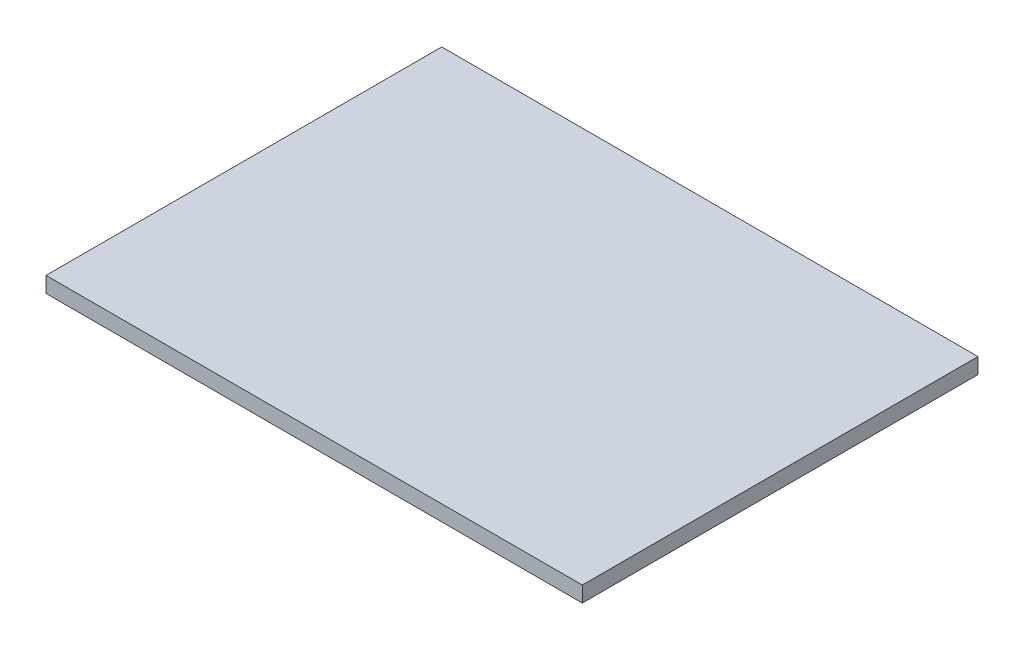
ISO-10303-21;
HEADER;
FILE_DESCRIPTION(('STEP AP214'),'2;1');
FILE_NAME('part.step','',(''),(''),'','','');
FILE_SCHEMA(('AUTOMOTIVE_DESIGN { 1 0 10303 214 1 1 1 1 }'));
ENDSEC;
DATA;
#1=APPLICATION_CONTEXT('core data for automotive mechanical design processes');
#2=APPLICATION_PROTOCOL_DEFINITION('international standard','automotive_design',2000,#1);
#3=PRODUCT_CONTEXT('',#1,'mechanical');
#4=PRODUCT('Part','Part','',(#3));
#5=PRODUCT_RELATED_PRODUCT_CATEGORY('part','',(#4));
#6=PRODUCT_DEFINITION_FORMATION('','',#4);
#7=PRODUCT_DEFINITION_CONTEXT('part definition',#1,'design');
#8=PRODUCT_DEFINITION('design','',#6,#7);
#9=PRODUCT_DEFINITION_SHAPE('','',#8);
#10=(LENGTH_UNIT() NAMED_UNIT(*) SI_UNIT(.MILLI.,.METRE.));
#11=(NAMED_UNIT(*) PLANE_ANGLE_UNIT() SI_UNIT($,.RADIAN.));
#12=(NAMED_UNIT(*) SI_UNIT($,.STERADIAN.) SOLID_ANGLE_UNIT());
#13=UNCERTAINTY_MEASURE_WITH_UNIT(LENGTH_MEASURE(1.E-05),#10,'distance_accuracy_value','');
#14=(GEOMETRIC_REPRESENTATION_CONTEXT(3) GLOBAL_UNCERTAINTY_ASSIGNED_CONTEXT((#13)) GLOBAL_UNIT_ASSIGNED_CONTEXT((#10,
#11,#12)) REPRESENTATION_CONTEXT('',''));
#15=CARTESIAN_POINT('',(0.,0.,0.));
#16=DIRECTION('',(0.,0.,1.));
#17=DIRECTION('',(1.,0.,0.));
#18=AXIS2_PLACEMENT_3D('',#15,#16,#17);
#19=CARTESIAN_POINT('',(327.025,9.525,-241.3));
#20=DIRECTION('',(-1.,0.,0.));
#21=DIRECTION('',(0.,0.,1.));
#22=AXIS2_PLACEMENT_3D('',#19,#20,#21);
#23=PLANE('',#22);
#24=DIRECTION('',(0.,0.,-1.));
#25=VECTOR('',#24,1.);
#26=CARTESIAN_POINT('',(327.025,-9.525,-241.3));
#27=LINE('',#26,#25);
#28=CARTESIAN_POINT('',(327.025,-9.525,241.3));
#29=VERTEX_POINT('',#28);
#30=CARTESIAN_POINT('',(327.025,-9.525,-241.3));
#31=VERTEX_POINT('',#30);
#32=EDGE_CURVE('E95',#29,#31,#27,.T.);
#33=ORIENTED_EDGE('',*,*,#32,.T.);
#34=DIRECTION('',(0.,-1.,0.));
#35=VECTOR('',#34,1.);
#36=CARTESIAN_POINT('',(327.025,9.525,-241.3));
#37=LINE('',#36,#35);
#38=CARTESIAN_POINT('',(327.025,9.525,-241.3));
#39=VERTEX_POINT('',#38);
#40=EDGE_CURVE('E11',#39,#31,#37,.T.);
#41=ORIENTED_EDGE('',*,*,#40,.F.);
#42=DIRECTION('',(0.,0.,-1.));
#43=VECTOR('',#42,1.);
#44=CARTESIAN_POINT('',(327.025,9.525,-241.3));
#45=LINE('',#44,#43);
#46=CARTESIAN_POINT('',(327.025,9.525,241.3));
#47=VERTEX_POINT('',#46);
#48=EDGE_CURVE('E83',#47,#39,#45,.T.);
#49=ORIENTED_EDGE('',*,*,#48,.F.);
#50=DIRECTION('',(0.,-1.,0.));
#51=VECTOR('',#50,1.);
#52=CARTESIAN_POINT('',(327.025,9.525,241.3));
#53=LINE('',#52,#51);
#54=EDGE_CURVE('E91',#47,#29,#53,.T.);
#55=ORIENTED_EDGE('',*,*,#54,.T.);
#56=EDGE_LOOP('',(#33,#41,#49,#55));
#57=FACE_BOUND('',#56,.T.);
#58=ADVANCED_FACE('F32',(#57),#23,.F.);
#59=CARTESIAN_POINT('',(-327.025,9.525,-241.3));
#60=DIRECTION('',(0.,0.,1.));
#61=DIRECTION('',(1.,0.,0.));
#62=AXIS2_PLACEMENT_3D('',#59,#60,#61);
#63=PLANE('',#62);
#64=DIRECTION('',(-1.,0.,0.));
#65=VECTOR('',#64,1.);
#66=CARTESIAN_POINT('',(-327.025,-9.525,-241.3));
#67=LINE('',#66,#65);
#68=CARTESIAN_POINT('',(-327.025,-9.525,-241.3));
#69=VERTEX_POINT('',#68);
#70=EDGE_CURVE('E87',#31,#69,#67,.T.);
#71=ORIENTED_EDGE('',*,*,#70,.T.);
#72=DIRECTION('',(0.,-1.,0.));
#73=VECTOR('',#72,1.);
#74=CARTESIAN_POINT('',(-327.025,9.525,-241.3));
#75=LINE('',#74,#73);
#76=CARTESIAN_POINT('',(-327.025,9.525,-241.3));
#77=VERTEX_POINT('',#76);
#78=EDGE_CURVE('E40',#77,#69,#75,.T.);
#79=ORIENTED_EDGE('',*,*,#78,.F.);
#80=DIRECTION('',(-1.,0.,0.));
#81=VECTOR('',#80,1.);
#82=CARTESIAN_POINT('',(-327.025,9.525,-241.3));
#83=LINE('',#82,#81);
#84=EDGE_CURVE('E78',#39,#77,#83,.T.);
#85=ORIENTED_EDGE('',*,*,#84,.F.);
#86=ORIENTED_EDGE('',*,*,#40,.T.);
#87=EDGE_LOOP('',(#71,#79,#85,#86));
#88=FACE_BOUND('',#87,.T.);
#89=ADVANCED_FACE('F86',(#88),#63,.F.);
#90=CARTESIAN_POINT('',(-327.025,9.525,-241.3));
#91=DIRECTION('',(1.,0.,0.));
#92=DIRECTION('',(0.,0.,-1.));
#93=AXIS2_PLACEMENT_3D('',#90,#91,#92);
#94=PLANE('',#93);
#95=DIRECTION('',(0.,0.,1.));
#96=VECTOR('',#95,1.);
#97=CARTESIAN_POINT('',(-327.025,-9.525,-241.3));
#98=LINE('',#97,#96);
#99=CARTESIAN_POINT('',(-327.025,-9.525,241.3));
#100=VERTEX_POINT('',#99);
#101=EDGE_CURVE('E65',#69,#100,#98,.T.);
#102=ORIENTED_EDGE('',*,*,#101,.T.);
#103=DIRECTION('',(0.,-1.,0.));
#104=VECTOR('',#103,1.);
#105=CARTESIAN_POINT('',(-327.025,9.525,241.3));
#106=LINE('',#105,#104);
#107=CARTESIAN_POINT('',(-327.025,9.525,241.3));
#108=VERTEX_POINT('',#107);
#109=EDGE_CURVE('E88',#108,#100,#106,.T.);
#110=ORIENTED_EDGE('',*,*,#109,.F.);
#111=DIRECTION('',(0.,0.,1.));
#112=VECTOR('',#111,1.);
#113=CARTESIAN_POINT('',(-327.025,9.525,-241.3));
#114=LINE('',#113,#112);
#115=EDGE_CURVE('E81',#77,#108,#114,.T.);
#116=ORIENTED_EDGE('',*,*,#115,.F.);
#117=ORIENTED_EDGE('',*,*,#78,.T.);
#118=EDGE_LOOP('',(#102,#110,#116,#117));
#119=FACE_BOUND('',#118,.T.);
#120=ADVANCED_FACE('F89',(#119),#94,.F.);
#121=CARTESIAN_POINT('',(-327.025,9.525,241.3));
#122=DIRECTION('',(0.,0.,-1.));
#123=DIRECTION('',(-1.,0.,0.));
#124=AXIS2_PLACEMENT_3D('',#121,#122,#123);
#125=PLANE('',#124);
#126=DIRECTION('',(1.,0.,0.));
#127=VECTOR('',#126,1.);
#128=CARTESIAN_POINT('',(-327.025,-9.525,241.3));
#129=LINE('',#128,#127);
#130=EDGE_CURVE('E71',#100,#29,#129,.T.);
#131=ORIENTED_EDGE('',*,*,#130,.T.);
#132=ORIENTED_EDGE('',*,*,#54,.F.);
#133=DIRECTION('',(1.,0.,0.));
#134=VECTOR('',#133,1.);
#135=CARTESIAN_POINT('',(-327.025,9.525,241.3));
#136=LINE('',#135,#134);
#137=EDGE_CURVE('E48',#108,#47,#136,.T.);
#138=ORIENTED_EDGE('',*,*,#137,.F.);
#139=ORIENTED_EDGE('',*,*,#109,.T.);
#140=EDGE_LOOP('',(#131,#132,#138,#139));
#141=FACE_BOUND('',#140,.T.);
#142=ADVANCED_FACE('F102',(#141),#125,.F.);
#143=CARTESIAN_POINT('',(327.025,9.525,241.3));
#144=DIRECTION('',(0.,1.,0.));
#145=DIRECTION('',(0.,0.,1.));
#146=AXIS2_PLACEMENT_3D('',#143,#144,#145);
#147=PLANE('',#146);
#148=ORIENTED_EDGE('',*,*,#48,.T.);
#149=ORIENTED_EDGE('',*,*,#84,.T.);
#150=ORIENTED_EDGE('',*,*,#115,.T.);
#151=ORIENTED_EDGE('',*,*,#137,.T.);
#152=EDGE_LOOP('',(#148,#149,#150,#151));
#153=FACE_BOUND('',#152,.T.);
#154=ADVANCED_FACE('F79',(#153),#147,.T.);
#155=CARTESIAN_POINT('',(327.025,-9.525,241.3));
#156=DIRECTION('',(0.,1.,0.));
#157=DIRECTION('',(0.,0.,1.));
#158=AXIS2_PLACEMENT_3D('',#155,#156,#157);
#159=PLANE('',#158);
#160=ORIENTED_EDGE('',*,*,#32,.F.);
#161=ORIENTED_EDGE('',*,*,#130,.F.);
#162=ORIENTED_EDGE('',*,*,#101,.F.);
#163=ORIENTED_EDGE('',*,*,#70,.F.);
#164=EDGE_LOOP('',(#160,#161,#162,#163));
#165=FACE_BOUND('',#164,.T.);
#166=ADVANCED_FACE('F105',(#165),#159,.F.);
#167=CLOSED_SHELL('',(#58,#89,#120,#142,#154,#166));
#168=MANIFOLD_SOLID_BREP('B2',#167);
#169=ADVANCED_BREP_SHAPE_REPRESENTATION('',(#18,#168),#14);
#170=SHAPE_DEFINITION_REPRESENTATION(#9,#169);
ENDSEC;
END-ISO-10303-21;
